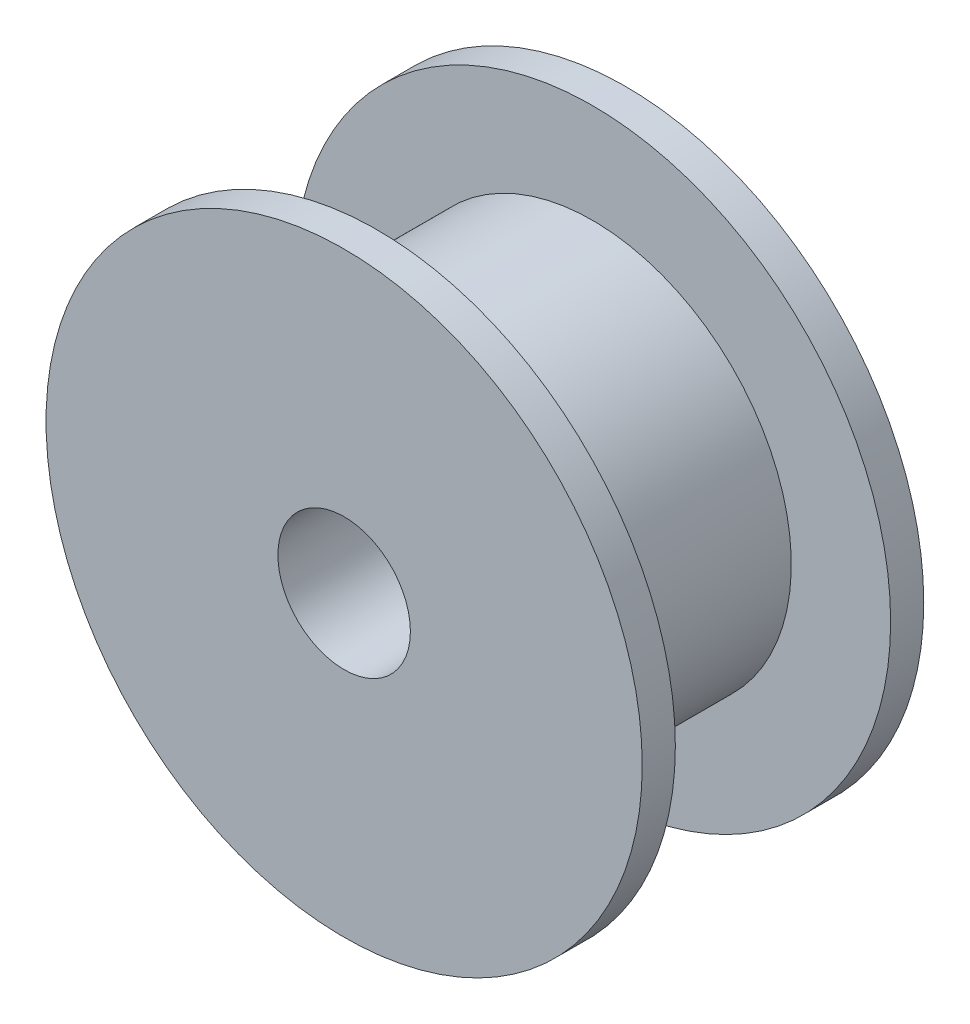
from build123d import *

# Parameters (mm, degrees)
CROQUIS1_R              = 9
CROQUIS1_R_2            = 2
SALIENTE_EXTRUIR1_DEPTH = 1
CROQUIS2_R              = 6
CROQUIS2_R_2            = 2
SALIENTE_EXTRUIR2_DEPTH = 6.5
CROQUIS3_R              = 9
CROQUIS3_R_2            = 2
SALIENTE_EXTRUIR3_DEPTH = 1


with BuildPart() as part:
    # Croquis1 → Saliente-Extruir1 (new body)
    with BuildSketch(Plane.XY):
        Circle(CROQUIS1_R)
        Circle(CROQUIS1_R_2, mode=Mode.SUBTRACT)
    extrude(amount=SALIENTE_EXTRUIR1_DEPTH)

    # Croquis2 → Saliente-Extruir2 (add)
    with BuildSketch(Plane.XY.offset(1)):
        with Locations(Location((0, 0, 0), (0, 0, 180))):
            Circle(CROQUIS2_R)
        Circle(CROQUIS2_R_2, mode=Mode.SUBTRACT)
    extrude(amount=SALIENTE_EXTRUIR2_DEPTH)

    # Croquis3 → Saliente-Extruir3 (add)
    with BuildSketch(Plane.XY.offset(7.5)):
        Circle(CROQUIS3_R)
        Circle(CROQUIS3_R_2, mode=Mode.SUBTRACT)
    extrude(amount=SALIENTE_EXTRUIR3_DEPTH)


solid = part.part
